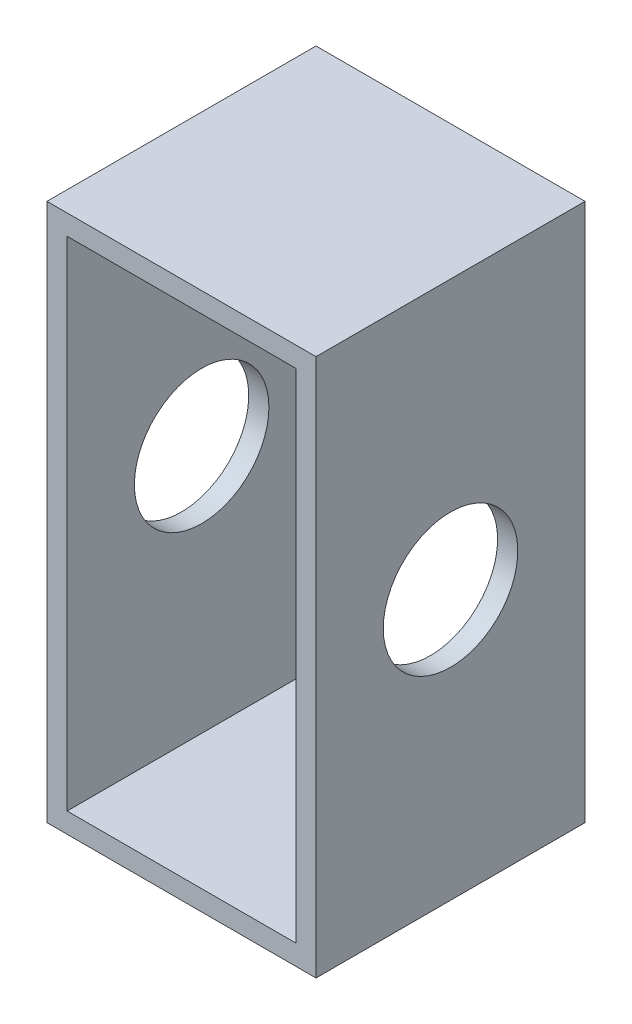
from build123d import *

# Parameters (mm, degrees)
SCHIZZO1_W                   = 40
SCHIZZO1_H                   = 80
SCHIZZO1_W_2                 = 34
SCHIZZO1_H_2                 = 74
ESTRUSIONE_ESTRUSIONE1_DEPTH = 20
TAGLIO_ESTRUSIONE1_REACH     = 62
SCHIZZO3_R                   = 10


with BuildPart() as part:
    # Schizzo1 → Estrusione-Estrusione1 (new, symmetric)
    with BuildSketch(Plane.XY):
        Rectangle(SCHIZZO1_W, SCHIZZO1_H)
        Rectangle(SCHIZZO1_W_2, SCHIZZO1_H_2, mode=Mode.SUBTRACT)
    extrude(amount=ESTRUSIONE_ESTRUSIONE1_DEPTH, both=True)

    # Taglio-Estrusione1: up to this face of the body (flat: up to its plane)
    taglio_estrusione1_end = Plane(part.part.faces().sort_by_distance((20, 0, 0))[0])
    # Schizzo3 → Taglio-Estrusione1 (cut, up to the picked face)
    with BuildSketch(Plane.ZY.offset(20), mode=Mode.PRIVATE) as taglio_estrusione1_sk1:
        Circle(SCHIZZO3_R)
    taglio_estrusione1_tool1 = split(extrude(taglio_estrusione1_sk1.sketch, amount=-TAGLIO_ESTRUSIONE1_REACH, mode=Mode.PRIVATE), bisect_by=taglio_estrusione1_end, keep=Keep.BOTH, mode=Mode.PRIVATE)
    add(taglio_estrusione1_tool1.solids().sort_by(Axis((-20, 0, 0), (1, 0, 0)))[0], mode=Mode.SUBTRACT)


solid = part.part
